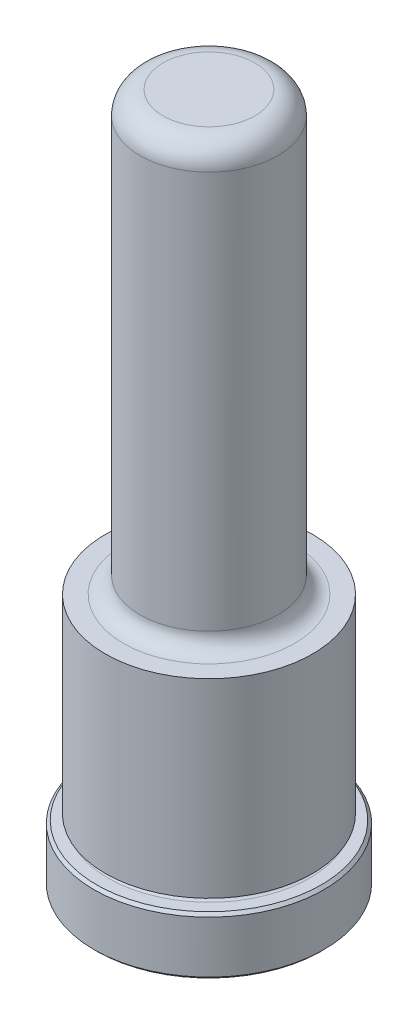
ISO-10303-21;
HEADER;
FILE_DESCRIPTION(('STEP AP214'),'2;1');
FILE_NAME('part.step','',(''),(''),'','','');
FILE_SCHEMA(('AUTOMOTIVE_DESIGN { 1 0 10303 214 1 1 1 1 }'));
ENDSEC;
DATA;
#1=APPLICATION_CONTEXT('core data for automotive mechanical design processes');
#2=APPLICATION_PROTOCOL_DEFINITION('international standard','automotive_design',2000,#1);
#3=PRODUCT_CONTEXT('',#1,'mechanical');
#4=PRODUCT('Part','Part','',(#3));
#5=PRODUCT_RELATED_PRODUCT_CATEGORY('part','',(#4));
#6=PRODUCT_DEFINITION_FORMATION('','',#4);
#7=PRODUCT_DEFINITION_CONTEXT('part definition',#1,'design');
#8=PRODUCT_DEFINITION('design','',#6,#7);
#9=PRODUCT_DEFINITION_SHAPE('','',#8);
#10=(LENGTH_UNIT() NAMED_UNIT(*) SI_UNIT(.MILLI.,.METRE.));
#11=(NAMED_UNIT(*) PLANE_ANGLE_UNIT() SI_UNIT($,.RADIAN.));
#12=(NAMED_UNIT(*) SI_UNIT($,.STERADIAN.) SOLID_ANGLE_UNIT());
#13=UNCERTAINTY_MEASURE_WITH_UNIT(LENGTH_MEASURE(1.E-05),#10,'distance_accuracy_value','');
#14=(GEOMETRIC_REPRESENTATION_CONTEXT(3) GLOBAL_UNCERTAINTY_ASSIGNED_CONTEXT((#13)) GLOBAL_UNIT_ASSIGNED_CONTEXT((#10,
#11,#12)) REPRESENTATION_CONTEXT('',''));
#15=CARTESIAN_POINT('',(0.,0.,0.));
#16=DIRECTION('',(0.,0.,1.));
#17=DIRECTION('',(1.,0.,0.));
#18=AXIS2_PLACEMENT_3D('',#15,#16,#17);
#19=CARTESIAN_POINT('',(0.,0.,0.));
#20=DIRECTION('',(0.,1.,0.));
#21=DIRECTION('',(0.,0.,1.));
#22=AXIS2_PLACEMENT_3D('',#19,#20,#21);
#23=PLANE('',#22);
#24=CARTESIAN_POINT('',(0.,0.,0.));
#25=DIRECTION('',(0.,1.,0.));
#26=DIRECTION('',(0.,0.,1.));
#27=AXIS2_PLACEMENT_3D('',#24,#25,#26);
#28=CIRCLE('',#27,15.494);
#29=CARTESIAN_POINT('',(0.,0.,15.494));
#30=VERTEX_POINT('',#29);
#31=EDGE_CURVE('E46',#30,#30,#28,.F.);
#32=ORIENTED_EDGE('',*,*,#31,.T.);
#33=EDGE_LOOP('',(#32));
#34=FACE_BOUND('',#33,.T.);
#35=ADVANCED_FACE('F31',(#34),#23,.F.);
#36=CARTESIAN_POINT('',(0.,0.,0.));
#37=DIRECTION('',(0.,1.,0.));
#38=DIRECTION('',(0.,0.,1.));
#39=AXIS2_PLACEMENT_3D('',#36,#37,#38);
#40=CYLINDRICAL_SURFACE('',#39,15.875);
#41=CARTESIAN_POINT('',(0.,0.380999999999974,0.));
#42=DIRECTION('',(0.,1.,0.));
#43=DIRECTION('',(0.,0.,1.));
#44=AXIS2_PLACEMENT_3D('',#41,#42,#43);
#45=CIRCLE('',#44,15.875);
#46=CARTESIAN_POINT('',(0.,0.380999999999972,15.875));
#47=VERTEX_POINT('',#46);
#48=EDGE_CURVE('E51',#47,#47,#45,.T.);
#49=ORIENTED_EDGE('',*,*,#48,.T.);
#50=EDGE_LOOP('',(#49));
#51=FACE_BOUND('',#50,.T.);
#52=CARTESIAN_POINT('',(0.,7.54380000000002,0.));
#53=DIRECTION('',(0.,-1.,0.));
#54=DIRECTION('',(0.,0.,-1.));
#55=AXIS2_PLACEMENT_3D('',#52,#53,#54);
#56=CIRCLE('',#55,15.875);
#57=CARTESIAN_POINT('',(0.,7.54380000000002,-15.875));
#58=VERTEX_POINT('',#57);
#59=EDGE_CURVE('E54',#58,#58,#56,.T.);
#60=ORIENTED_EDGE('',*,*,#59,.T.);
#61=EDGE_LOOP('',(#60));
#62=FACE_BOUND('',#61,.T.);
#63=ADVANCED_FACE('F110',(#51,#62),#40,.T.);
#64=CARTESIAN_POINT('',(0.,7.9248,-15.875));
#65=DIRECTION('',(0.,-1.,0.));
#66=DIRECTION('',(0.,0.,-1.));
#67=AXIS2_PLACEMENT_3D('',#64,#65,#66);
#68=PLANE('',#67);
#69=CARTESIAN_POINT('',(0.,7.9248,0.));
#70=DIRECTION('',(0.,-1.,0.));
#71=DIRECTION('',(0.,0.,-1.));
#72=AXIS2_PLACEMENT_3D('',#69,#70,#71);
#73=CIRCLE('',#72,15.494);
#74=CARTESIAN_POINT('',(0.,7.9248,-15.494));
#75=VERTEX_POINT('',#74);
#76=EDGE_CURVE('E42',#75,#75,#73,.F.);
#77=ORIENTED_EDGE('',*,*,#76,.T.);
#78=EDGE_LOOP('',(#77));
#79=FACE_BOUND('',#78,.T.);
#80=CARTESIAN_POINT('',(0.,7.9248,0.));
#81=DIRECTION('',(0.,1.,0.));
#82=DIRECTION('',(0.,0.,1.));
#83=AXIS2_PLACEMENT_3D('',#80,#81,#82);
#84=CIRCLE('',#83,13.8938);
#85=CARTESIAN_POINT('',(0.,7.9248,13.8938));
#86=VERTEX_POINT('',#85);
#87=EDGE_CURVE('E57',#86,#86,#84,.T.);
#88=ORIENTED_EDGE('',*,*,#87,.F.);
#89=EDGE_LOOP('',(#88));
#90=FACE_BOUND('',#89,.T.);
#91=ADVANCED_FACE('F105',(#79,#90),#68,.F.);
#92=CARTESIAN_POINT('',(0.,8.3058,0.));
#93=DIRECTION('',(0.,1.,0.));
#94=DIRECTION('',(0.,0.,1.));
#95=AXIS2_PLACEMENT_3D('',#92,#93,#94);
#96=TOROIDAL_SURFACE('',#95,13.8938,0.381000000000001);
#97=CARTESIAN_POINT('',(0.,8.68680000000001,0.));
#98=DIRECTION('',(0.,1.,0.));
#99=DIRECTION('',(0.,0.,1.));
#100=AXIS2_PLACEMENT_3D('',#97,#98,#99);
#101=CIRCLE('',#100,13.8938);
#102=CARTESIAN_POINT('',(0.,8.6868,13.8938));
#103=VERTEX_POINT('',#102);
#104=EDGE_CURVE('E60',#103,#103,#101,.T.);
#105=ORIENTED_EDGE('',*,*,#104,.F.);
#106=EDGE_LOOP('',(#105));
#107=FACE_BOUND('',#106,.T.);
#108=ORIENTED_EDGE('',*,*,#87,.T.);
#109=EDGE_LOOP('',(#108));
#110=FACE_BOUND('',#109,.T.);
#111=ADVANCED_FACE('F99',(#107,#110),#96,.F.);
#112=CARTESIAN_POINT('',(0.,8.68680000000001,-13.8938));
#113=DIRECTION('',(0.,1.,0.));
#114=DIRECTION('',(0.,0.,1.));
#115=AXIS2_PLACEMENT_3D('',#112,#113,#114);
#116=PLANE('',#115);
#117=CARTESIAN_POINT('',(0.,8.6868,0.));
#118=DIRECTION('',(0.,1.,0.));
#119=DIRECTION('',(0.,0.,1.));
#120=AXIS2_PLACEMENT_3D('',#117,#118,#119);
#121=CIRCLE('',#120,14.3002);
#122=CARTESIAN_POINT('',(0.,8.6868,14.3002));
#123=VERTEX_POINT('',#122);
#124=EDGE_CURVE('E63',#123,#123,#121,.T.);
#125=ORIENTED_EDGE('',*,*,#124,.F.);
#126=EDGE_LOOP('',(#125));
#127=FACE_BOUND('',#126,.T.);
#128=ORIENTED_EDGE('',*,*,#104,.T.);
#129=EDGE_LOOP('',(#128));
#130=FACE_BOUND('',#129,.T.);
#131=ADVANCED_FACE('F93',(#127,#130),#116,.F.);
#132=CARTESIAN_POINT('',(0.,0.,0.));
#133=DIRECTION('',(0.,1.,0.));
#134=DIRECTION('',(0.,0.,1.));
#135=AXIS2_PLACEMENT_3D('',#132,#133,#134);
#136=CYLINDRICAL_SURFACE('',#135,14.3002);
#137=CARTESIAN_POINT('',(0.,34.925,0.));
#138=DIRECTION('',(0.,1.,0.));
#139=DIRECTION('',(0.,0.,1.));
#140=AXIS2_PLACEMENT_3D('',#137,#138,#139);
#141=CIRCLE('',#140,14.3002);
#142=CARTESIAN_POINT('',(0.,34.925,14.3002));
#143=VERTEX_POINT('',#142);
#144=EDGE_CURVE('E66',#143,#143,#141,.T.);
#145=ORIENTED_EDGE('',*,*,#144,.F.);
#146=EDGE_LOOP('',(#145));
#147=FACE_BOUND('',#146,.T.);
#148=ORIENTED_EDGE('',*,*,#124,.T.);
#149=EDGE_LOOP('',(#148));
#150=FACE_BOUND('',#149,.T.);
#151=ADVANCED_FACE('F87',(#147,#150),#136,.T.);
#152=CARTESIAN_POINT('',(0.,34.925,-14.3002));
#153=DIRECTION('',(0.,-1.,0.));
#154=DIRECTION('',(0.,0.,-1.));
#155=AXIS2_PLACEMENT_3D('',#152,#153,#154);
#156=PLANE('',#155);
#157=CARTESIAN_POINT('',(0.,34.925,0.));
#158=DIRECTION('',(0.,1.,0.));
#159=DIRECTION('',(0.,0.,1.));
#160=AXIS2_PLACEMENT_3D('',#157,#158,#159);
#161=CIRCLE('',#160,11.7983);
#162=CARTESIAN_POINT('',(0.,34.925,11.7983));
#163=VERTEX_POINT('',#162);
#164=EDGE_CURVE('E69',#163,#163,#161,.T.);
#165=ORIENTED_EDGE('',*,*,#164,.F.);
#166=EDGE_LOOP('',(#165));
#167=FACE_BOUND('',#166,.T.);
#168=ORIENTED_EDGE('',*,*,#144,.T.);
#169=EDGE_LOOP('',(#168));
#170=FACE_BOUND('',#169,.T.);
#171=ADVANCED_FACE('F81',(#167,#170),#156,.F.);
#172=CARTESIAN_POINT('',(0.,37.211,0.));
#173=DIRECTION('',(0.,1.,0.));
#174=DIRECTION('',(0.,0.,1.));
#175=AXIS2_PLACEMENT_3D('',#172,#173,#174);
#176=TOROIDAL_SURFACE('',#175,11.7983,2.28599999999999);
#177=CARTESIAN_POINT('',(0.,37.211,0.));
#178=DIRECTION('',(0.,1.,0.));
#179=DIRECTION('',(0.,0.,1.));
#180=AXIS2_PLACEMENT_3D('',#177,#178,#179);
#181=CIRCLE('',#180,9.51230000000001);
#182=CARTESIAN_POINT('',(0.,37.211,9.51230000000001));
#183=VERTEX_POINT('',#182);
#184=EDGE_CURVE('E72',#183,#183,#181,.T.);
#185=ORIENTED_EDGE('',*,*,#184,.F.);
#186=EDGE_LOOP('',(#185));
#187=FACE_BOUND('',#186,.T.);
#188=ORIENTED_EDGE('',*,*,#164,.T.);
#189=EDGE_LOOP('',(#188));
#190=FACE_BOUND('',#189,.T.);
#191=ADVANCED_FACE('F78',(#187,#190),#176,.F.);
#192=CARTESIAN_POINT('',(0.,0.,0.));
#193=DIRECTION('',(0.,1.,0.));
#194=DIRECTION('',(0.,0.,1.));
#195=AXIS2_PLACEMENT_3D('',#192,#193,#194);
#196=CYLINDRICAL_SURFACE('',#195,9.51230000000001);
#197=CARTESIAN_POINT('',(0.,92.075,0.));
#198=DIRECTION('',(0.,-1.,0.));
#199=DIRECTION('',(0.,0.,-1.));
#200=AXIS2_PLACEMENT_3D('',#197,#198,#199);
#201=CIRCLE('',#200,9.51230000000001);
#202=CARTESIAN_POINT('',(0.,92.075,-9.51229999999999));
#203=VERTEX_POINT('',#202);
#204=EDGE_CURVE('E10',#203,#203,#201,.T.);
#205=ORIENTED_EDGE('',*,*,#204,.T.);
#206=EDGE_LOOP('',(#205));
#207=FACE_BOUND('',#206,.T.);
#208=ORIENTED_EDGE('',*,*,#184,.T.);
#209=EDGE_LOOP('',(#208));
#210=FACE_BOUND('',#209,.T.);
#211=ADVANCED_FACE('F76',(#207,#210),#196,.T.);
#212=CARTESIAN_POINT('',(0.,95.25,-9.51229999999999));
#213=DIRECTION('',(0.,-1.,0.));
#214=DIRECTION('',(0.,0.,-1.));
#215=AXIS2_PLACEMENT_3D('',#212,#213,#214);
#216=PLANE('',#215);
#217=CARTESIAN_POINT('',(0.,95.25,0.));
#218=DIRECTION('',(0.,-1.,0.));
#219=DIRECTION('',(0.,0.,-1.));
#220=AXIS2_PLACEMENT_3D('',#217,#218,#219);
#221=CIRCLE('',#220,6.33730000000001);
#222=CARTESIAN_POINT('',(0.,95.25,-6.33729999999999));
#223=VERTEX_POINT('',#222);
#224=EDGE_CURVE('E38',#223,#223,#221,.F.);
#225=ORIENTED_EDGE('',*,*,#224,.T.);
#226=EDGE_LOOP('',(#225));
#227=FACE_BOUND('',#226,.T.);
#228=ADVANCED_FACE('F127',(#227),#216,.F.);
#229=CARTESIAN_POINT('',(0.,0.380999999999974,0.));
#230=DIRECTION('',(0.,1.,0.));
#231=DIRECTION('',(0.,0.,1.));
#232=AXIS2_PLACEMENT_3D('',#229,#230,#231);
#233=CONICAL_SURFACE('',#232,15.875,0.785398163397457);
#234=ORIENTED_EDGE('',*,*,#31,.F.);
#235=EDGE_LOOP('',(#234));
#236=FACE_BOUND('',#235,.T.);
#237=ORIENTED_EDGE('',*,*,#48,.F.);
#238=EDGE_LOOP('',(#237));
#239=FACE_BOUND('',#238,.T.);
#240=ADVANCED_FACE('F124',(#236,#239),#233,.T.);
#241=CARTESIAN_POINT('',(0.,7.9248,0.));
#242=DIRECTION('',(0.,-1.,0.));
#243=DIRECTION('',(0.,0.,-1.));
#244=AXIS2_PLACEMENT_3D('',#241,#242,#243);
#245=CONICAL_SURFACE('',#244,15.494,0.785398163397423);
#246=ORIENTED_EDGE('',*,*,#59,.F.);
#247=EDGE_LOOP('',(#246));
#248=FACE_BOUND('',#247,.T.);
#249=ORIENTED_EDGE('',*,*,#76,.F.);
#250=EDGE_LOOP('',(#249));
#251=FACE_BOUND('',#250,.T.);
#252=ADVANCED_FACE('F126',(#248,#251),#245,.T.);
#253=CARTESIAN_POINT('',(0.,92.075,0.));
#254=DIRECTION('',(0.,-1.,0.));
#255=DIRECTION('',(0.,0.,-1.));
#256=AXIS2_PLACEMENT_3D('',#253,#254,#255);
#257=TOROIDAL_SURFACE('',#256,6.33730000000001,3.175);
#258=ORIENTED_EDGE('',*,*,#204,.F.);
#259=EDGE_LOOP('',(#258));
#260=FACE_BOUND('',#259,.T.);
#261=ORIENTED_EDGE('',*,*,#224,.F.);
#262=EDGE_LOOP('',(#261));
#263=FACE_BOUND('',#262,.T.);
#264=ADVANCED_FACE('F33',(#260,#263),#257,.T.);
#265=CLOSED_SHELL('',(#35,#63,#91,#111,#131,#151,#171,#191,#211,#228,#240,#252,#264));
#266=MANIFOLD_SOLID_BREP('B2',#265);
#267=ADVANCED_BREP_SHAPE_REPRESENTATION('',(#18,#266),#14);
#268=SHAPE_DEFINITION_REPRESENTATION(#9,#267);
ENDSEC;
END-ISO-10303-21;
